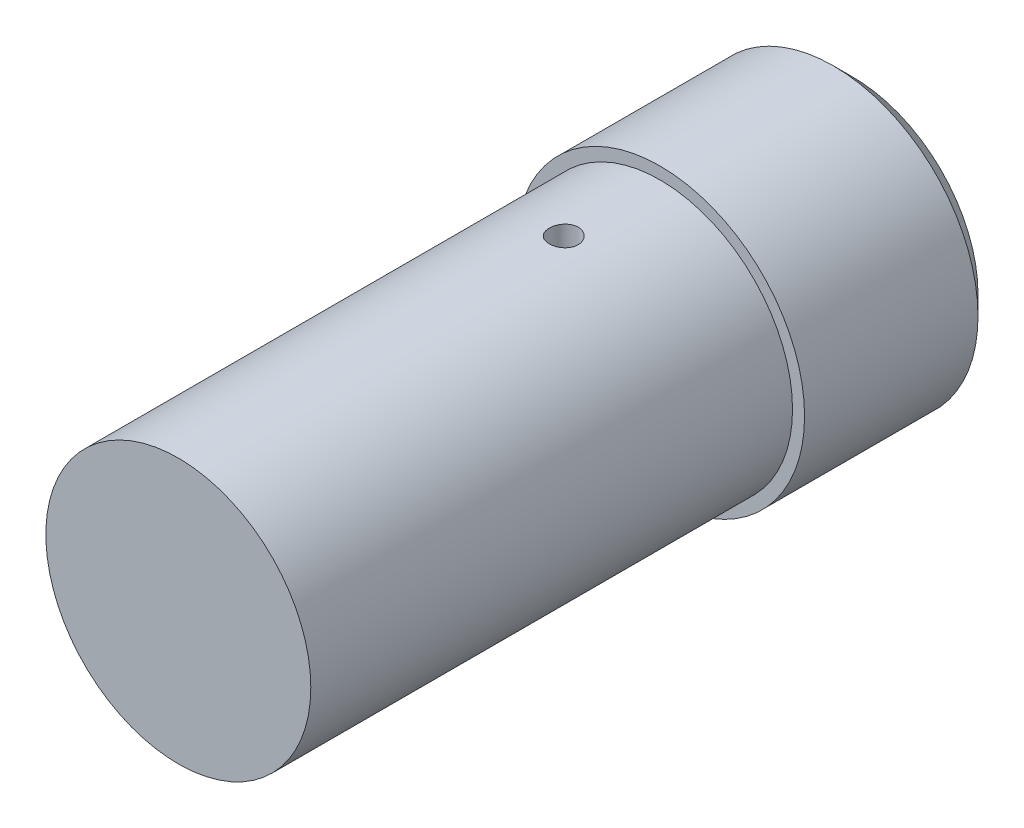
ISO-10303-21;
HEADER;
FILE_DESCRIPTION(('STEP AP214'),'2;1');
FILE_NAME('part.step','',(''),(''),'','','');
FILE_SCHEMA(('AUTOMOTIVE_DESIGN { 1 0 10303 214 1 1 1 1 }'));
ENDSEC;
DATA;
#1=APPLICATION_CONTEXT('core data for automotive mechanical design processes');
#2=APPLICATION_PROTOCOL_DEFINITION('international standard','automotive_design',2000,#1);
#3=PRODUCT_CONTEXT('',#1,'mechanical');
#4=PRODUCT('Part','Part','',(#3));
#5=PRODUCT_RELATED_PRODUCT_CATEGORY('part','',(#4));
#6=PRODUCT_DEFINITION_FORMATION('','',#4);
#7=PRODUCT_DEFINITION_CONTEXT('part definition',#1,'design');
#8=PRODUCT_DEFINITION('design','',#6,#7);
#9=PRODUCT_DEFINITION_SHAPE('','',#8);
#10=(LENGTH_UNIT() NAMED_UNIT(*) SI_UNIT(.MILLI.,.METRE.));
#11=(NAMED_UNIT(*) PLANE_ANGLE_UNIT() SI_UNIT($,.RADIAN.));
#12=(NAMED_UNIT(*) SI_UNIT($,.STERADIAN.) SOLID_ANGLE_UNIT());
#13=UNCERTAINTY_MEASURE_WITH_UNIT(LENGTH_MEASURE(1.E-05),#10,'distance_accuracy_value','');
#14=(GEOMETRIC_REPRESENTATION_CONTEXT(3) GLOBAL_UNCERTAINTY_ASSIGNED_CONTEXT((#13)) GLOBAL_UNIT_ASSIGNED_CONTEXT((#10,
#11,#12)) REPRESENTATION_CONTEXT('',''));
#15=CARTESIAN_POINT('',(0.,0.,0.));
#16=DIRECTION('',(0.,0.,1.));
#17=DIRECTION('',(1.,0.,0.));
#18=AXIS2_PLACEMENT_3D('',#15,#16,#17);
#19=CARTESIAN_POINT('',(0.,0.,40.));
#20=DIRECTION('',(0.,0.,1.));
#21=DIRECTION('',(1.,0.,0.));
#22=AXIS2_PLACEMENT_3D('',#19,#20,#21);
#23=PLANE('',#22);
#24=CARTESIAN_POINT('',(0.,0.,40.));
#25=DIRECTION('',(0.,0.,1.));
#26=DIRECTION('',(1.,0.,0.));
#27=AXIS2_PLACEMENT_3D('',#24,#25,#26);
#28=CIRCLE('',#27,30.);
#29=CARTESIAN_POINT('',(30.,0.,40.));
#30=VERTEX_POINT('',#29);
#31=EDGE_CURVE('E43',#30,#30,#28,.T.);
#32=ORIENTED_EDGE('',*,*,#31,.T.);
#33=EDGE_LOOP('',(#32));
#34=FACE_BOUND('',#33,.T.);
#35=CARTESIAN_POINT('',(0.,0.,40.));
#36=DIRECTION('',(0.,0.,1.));
#37=DIRECTION('',(1.,0.,0.));
#38=AXIS2_PLACEMENT_3D('',#35,#36,#37);
#39=CIRCLE('',#38,27.5);
#40=CARTESIAN_POINT('',(27.5,0.,40.));
#41=VERTEX_POINT('',#40);
#42=EDGE_CURVE('E57',#41,#41,#39,.T.);
#43=ORIENTED_EDGE('',*,*,#42,.F.);
#44=EDGE_LOOP('',(#43));
#45=FACE_BOUND('',#44,.T.);
#46=ADVANCED_FACE('F32',(#34,#45),#23,.T.);
#47=CARTESIAN_POINT('',(0.,0.,40.));
#48=DIRECTION('',(0.,0.,-1.));
#49=DIRECTION('',(-1.,0.,0.));
#50=AXIS2_PLACEMENT_3D('',#47,#48,#49);
#51=CYLINDRICAL_SURFACE('',#50,30.);
#52=CARTESIAN_POINT('',(0.,0.,4.00000000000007));
#53=DIRECTION('',(0.,0.,1.));
#54=DIRECTION('',(1.,0.,0.));
#55=AXIS2_PLACEMENT_3D('',#52,#53,#54);
#56=CIRCLE('',#55,30.);
#57=CARTESIAN_POINT('',(30.,0.,4.00000000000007));
#58=VERTEX_POINT('',#57);
#59=EDGE_CURVE('E39',#58,#58,#56,.T.);
#60=ORIENTED_EDGE('',*,*,#59,.T.);
#61=EDGE_LOOP('',(#60));
#62=FACE_BOUND('',#61,.T.);
#63=ORIENTED_EDGE('',*,*,#31,.F.);
#64=EDGE_LOOP('',(#63));
#65=FACE_BOUND('',#64,.T.);
#66=ADVANCED_FACE('F80',(#62,#65),#51,.T.);
#67=CARTESIAN_POINT('',(0.,0.,0.));
#68=DIRECTION('',(0.,0.,1.));
#69=DIRECTION('',(1.,0.,0.));
#70=AXIS2_PLACEMENT_3D('',#67,#68,#69);
#71=PLANE('',#70);
#72=CARTESIAN_POINT('',(0.,0.,0.));
#73=DIRECTION('',(0.,0.,1.));
#74=DIRECTION('',(1.,0.,0.));
#75=AXIS2_PLACEMENT_3D('',#72,#73,#74);
#76=CIRCLE('',#75,26.);
#77=CARTESIAN_POINT('',(26.,0.,0.));
#78=VERTEX_POINT('',#77);
#79=EDGE_CURVE('E10',#78,#78,#76,.F.);
#80=ORIENTED_EDGE('',*,*,#79,.T.);
#81=EDGE_LOOP('',(#80));
#82=FACE_BOUND('',#81,.T.);
#83=ADVANCED_FACE('F76',(#82),#71,.F.);
#84=CARTESIAN_POINT('',(0.,0.,140.));
#85=DIRECTION('',(0.,0.,-1.));
#86=DIRECTION('',(-1.,0.,0.));
#87=AXIS2_PLACEMENT_3D('',#84,#85,#86);
#88=CYLINDRICAL_SURFACE('',#87,27.5);
#89=CARTESIAN_POINT('',(0.,27.5,63.));
#90=CARTESIAN_POINT('',(-0.167975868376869,27.4999979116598,62.9999927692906));
#91=CARTESIAN_POINT('',(-0.336060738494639,27.4984446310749,62.9858445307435));
#92=CARTESIAN_POINT('',(-0.667564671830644,27.492397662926,62.9296213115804));
#93=CARTESIAN_POINT('',(-0.83097848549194,27.4879007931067,62.88751610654));
#94=CARTESIAN_POINT('',(-1.14829223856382,27.4764739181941,62.7766243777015));
#95=CARTESIAN_POINT('',(-1.30219807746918,27.4695454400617,62.7078545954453));
#96=CARTESIAN_POINT('',(-1.59625097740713,27.4540286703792,62.5456197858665));
#97=CARTESIAN_POINT('',(-1.73640063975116,27.445440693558,62.4521594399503));
#98=CARTESIAN_POINT('',(-1.99958990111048,27.4275251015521,62.2427713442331));
#99=CARTESIAN_POINT('',(-2.12256280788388,27.4181948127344,62.1267599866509));
#100=CARTESIAN_POINT('',(-2.34733416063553,27.3998680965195,61.8757418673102));
#101=CARTESIAN_POINT('',(-2.44913159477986,27.3908716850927,61.7407341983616));
#102=CARTESIAN_POINT('',(-2.62890315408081,27.374204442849,61.4551323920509));
#103=CARTESIAN_POINT('',(-2.70681613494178,27.3665370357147,61.304499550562));
#104=CARTESIAN_POINT('',(-2.8362166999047,27.353429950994,60.9921908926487));
#105=CARTESIAN_POINT('',(-2.88770505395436,27.3479902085,60.8305153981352));
#106=CARTESIAN_POINT('',(-2.96259521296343,27.3399790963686,60.5013957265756));
#107=CARTESIAN_POINT('',(-2.98610841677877,27.3373963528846,60.3339771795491));
#108=CARTESIAN_POINT('',(-3.00472529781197,27.3353565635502,59.9975517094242));
#109=CARTESIAN_POINT('',(-2.99982985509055,27.3358994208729,59.8285448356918));
#110=CARTESIAN_POINT('',(-2.96186009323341,27.3400390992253,59.4945109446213));
#111=CARTESIAN_POINT('',(-2.92890776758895,27.3436226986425,59.3294698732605));
#112=CARTESIAN_POINT('',(-2.83594963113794,27.353419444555,59.0072745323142));
#113=CARTESIAN_POINT('',(-2.77594339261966,27.3596326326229,58.8501203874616));
#114=CARTESIAN_POINT('',(-2.6304473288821,27.374003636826,58.5477767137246));
#115=CARTESIAN_POINT('',(-2.54490375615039,27.3821655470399,58.4026132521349));
#116=CARTESIAN_POINT('',(-2.35079985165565,27.3995110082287,58.1286569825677));
#117=CARTESIAN_POINT('',(-2.24223871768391,27.4086945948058,57.9998647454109));
#118=CARTESIAN_POINT('',(-2.00450176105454,27.4271075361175,57.761598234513));
#119=CARTESIAN_POINT('',(-1.87522065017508,27.4363368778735,57.6522289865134));
#120=CARTESIAN_POINT('',(-1.6000781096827,27.4537560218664,57.4567283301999));
#121=CARTESIAN_POINT('',(-1.45421665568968,27.4619458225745,57.3705969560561));
#122=CARTESIAN_POINT('',(-1.14997834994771,27.4763665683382,57.2240197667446));
#123=CARTESIAN_POINT('',(-0.991598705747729,27.4825970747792,57.1635797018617));
#124=CARTESIAN_POINT('',(-0.666856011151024,27.4923929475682,57.0701799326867));
#125=CARTESIAN_POINT('',(-0.500493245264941,27.495958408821,57.0372192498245));
#126=CARTESIAN_POINT('',(-0.165415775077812,27.5000102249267,56.9998480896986));
#127=CARTESIAN_POINT('',(0.00328259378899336,27.5005122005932,56.9952927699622));
#128=CARTESIAN_POINT('',(0.339040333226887,27.4984224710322,57.0144806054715));
#129=CARTESIAN_POINT('',(0.506099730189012,27.4958308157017,57.0382233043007));
#130=CARTESIAN_POINT('',(0.833416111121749,27.4878549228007,57.1132129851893));
#131=CARTESIAN_POINT('',(0.993688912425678,27.4824776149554,57.1643917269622));
#132=CARTESIAN_POINT('',(1.30337528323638,27.4695332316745,57.2927303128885));
#133=CARTESIAN_POINT('',(1.45278856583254,27.4619660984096,57.3698908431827));
#134=CARTESIAN_POINT('',(1.73716679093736,27.4454485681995,57.5483589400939));
#135=CARTESIAN_POINT('',(1.87207200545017,27.4364927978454,57.6497611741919));
#136=CARTESIAN_POINT('',(2.12299899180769,27.4182190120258,57.8736991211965));
#137=CARTESIAN_POINT('',(2.23902019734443,27.4089009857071,57.996235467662));
#138=CARTESIAN_POINT('',(2.44939239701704,27.3909054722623,58.2595973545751));
#139=CARTESIAN_POINT('',(2.54364800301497,27.3822309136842,58.4004993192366));
#140=CARTESIAN_POINT('',(2.70715660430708,27.3665503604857,58.6962178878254));
#141=CARTESIAN_POINT('',(2.77640999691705,27.3595443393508,58.8510342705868));
#142=CARTESIAN_POINT('',(2.8877903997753,27.348013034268,59.1698664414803));
#143=CARTESIAN_POINT('',(2.92997315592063,27.3434826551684,59.3338625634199));
#144=CARTESIAN_POINT('',(2.98619531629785,27.3374002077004,59.6666622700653));
#145=CARTESIAN_POINT('',(3.00023569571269,27.3358480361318,59.8354656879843));
#146=CARTESIAN_POINT('',(2.99975954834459,27.3359002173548,60.1721399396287));
#147=CARTESIAN_POINT('',(2.98539286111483,27.3374880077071,60.3400110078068));
#148=CARTESIAN_POINT('',(2.92882562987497,27.3436057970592,60.6709388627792));
#149=CARTESIAN_POINT('',(2.8866250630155,27.3481357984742,60.8339956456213));
#150=CARTESIAN_POINT('',(2.77563125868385,27.3596228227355,61.1506588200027));
#151=CARTESIAN_POINT('',(2.70684339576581,27.366579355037,61.30426711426));
#152=CARTESIAN_POINT('',(2.54464271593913,27.3821365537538,61.5977827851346));
#153=CARTESIAN_POINT('',(2.45122988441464,27.3907372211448,61.7376901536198));
#154=CARTESIAN_POINT('',(2.24187003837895,27.4086680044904,62.0006000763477));
#155=CARTESIAN_POINT('',(2.12581126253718,27.4180015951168,62.123513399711));
#156=CARTESIAN_POINT('',(1.87468089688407,27.4363151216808,62.3481823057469));
#157=CARTESIAN_POINT('',(1.73960478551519,27.4452949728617,62.4499328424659));
#158=CARTESIAN_POINT('',(1.45383048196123,27.4619174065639,62.6296312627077));
#159=CARTESIAN_POINT('',(1.30308750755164,27.4695559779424,62.707508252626));
#160=CARTESIAN_POINT('',(0.990672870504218,27.4825928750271,62.836737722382));
#161=CARTESIAN_POINT('',(0.829013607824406,27.4879936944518,62.8881197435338));
#162=CARTESIAN_POINT('',(0.555387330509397,27.494608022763,62.9502608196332));
#163=CARTESIAN_POINT('',(0.445162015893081,27.4966204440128,62.9688870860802));
#164=CARTESIAN_POINT('',(0.223307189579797,27.4993171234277,62.9937590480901));
#165=CARTESIAN_POINT('',(0.111677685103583,27.5000013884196,63.000004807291));
#166=CARTESIAN_POINT('',(0.,27.5,63.));
#167=B_SPLINE_CURVE_WITH_KNOTS('',3,(#89,#90,#91,#92,#93,#94,#95,#96,#97,#98,#99,#100,#101,#102,
#103,#104,#105,#106,#107,#108,#109,#110,#111,#112,#113,#114,#115,#116,#117,#118,#119,#120,#121,
#122,#123,#124,#125,#126,#127,#128,#129,#130,#131,#132,#133,#134,#135,#136,#137,#138,#139,#140,
#141,#142,#143,#144,#145,#146,#147,#148,#149,#150,#151,#152,#153,#154,#155,#156,#157,#158,#159,
#160,#161,#162,#163,#164,#165,#166),.UNSPECIFIED.,.T.,.F.,(4,2,2,2,2,2,2,2,2,2,2,2,2,2,2,2,2,2,
2,2,2,2,2,2,2,2,2,2,2,2,2,2,2,2,2,2,2,2,4),(0.,0.503519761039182,1.00758476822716,
1.51133380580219,2.01498739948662,2.52054518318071,3.02612711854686,3.53299274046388,
4.03984359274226,4.5446693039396,5.04947937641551,5.55210563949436,6.05473984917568,
6.55843948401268,7.06215667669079,7.56851976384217,8.07488359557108,8.58136070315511,
9.08781977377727,9.59169422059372,10.0955605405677,10.5981793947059,11.1008115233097,
11.6054395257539,12.1100826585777,12.6168971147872,13.1237035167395,13.6294628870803,
14.1352047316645,14.6382860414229,15.1413677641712,15.6443478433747,16.1473282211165,
16.6528567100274,17.1585055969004,17.6656418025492,18.1722113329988,18.5069749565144,
18.8417368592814),.UNSPECIFIED.);
#168=CARTESIAN_POINT('',(0.,27.5,63.));
#169=VERTEX_POINT('',#168);
#170=EDGE_CURVE('E50',#169,#169,#167,.T.);
#171=ORIENTED_EDGE('',*,*,#170,.T.);
#172=EDGE_LOOP('',(#171));
#173=FACE_BOUND('',#172,.T.);
#174=CARTESIAN_POINT('',(0.,0.,140.));
#175=DIRECTION('',(0.,0.,1.));
#176=DIRECTION('',(1.,0.,0.));
#177=AXIS2_PLACEMENT_3D('',#174,#175,#176);
#178=CIRCLE('',#177,27.5);
#179=CARTESIAN_POINT('',(27.5,0.,140.));
#180=VERTEX_POINT('',#179);
#181=EDGE_CURVE('E47',#180,#180,#178,.T.);
#182=ORIENTED_EDGE('',*,*,#181,.F.);
#183=EDGE_LOOP('',(#182));
#184=FACE_BOUND('',#183,.T.);
#185=ORIENTED_EDGE('',*,*,#42,.T.);
#186=EDGE_LOOP('',(#185));
#187=FACE_BOUND('',#186,.T.);
#188=ADVANCED_FACE('F60',(#173,#184,#187),#88,.T.);
#189=CARTESIAN_POINT('',(0.,0.,140.));
#190=DIRECTION('',(0.,0.,1.));
#191=DIRECTION('',(1.,0.,0.));
#192=AXIS2_PLACEMENT_3D('',#189,#190,#191);
#193=PLANE('',#192);
#194=ORIENTED_EDGE('',*,*,#181,.T.);
#195=EDGE_LOOP('',(#194));
#196=FACE_BOUND('',#195,.T.);
#197=ADVANCED_FACE('F69',(#196),#193,.T.);
#198=CARTESIAN_POINT('',(0.,0.,60.));
#199=DIRECTION('',(0.,1.,0.));
#200=DIRECTION('',(0.,0.,1.));
#201=AXIS2_PLACEMENT_3D('',#198,#199,#200);
#202=CYLINDRICAL_SURFACE('',#201,3.);
#203=CARTESIAN_POINT('',(0.,0.,60.));
#204=DIRECTION('',(0.,1.,0.));
#205=DIRECTION('',(0.,0.,1.));
#206=AXIS2_PLACEMENT_3D('',#203,#204,#205);
#207=CIRCLE('',#206,3.);
#208=CARTESIAN_POINT('',(0.,0.,63.));
#209=VERTEX_POINT('',#208);
#210=EDGE_CURVE('E58',#209,#209,#207,.T.);
#211=ORIENTED_EDGE('',*,*,#210,.F.);
#212=EDGE_LOOP('',(#211));
#213=FACE_BOUND('',#212,.T.);
#214=ORIENTED_EDGE('',*,*,#170,.F.);
#215=EDGE_LOOP('',(#214));
#216=FACE_BOUND('',#215,.T.);
#217=ADVANCED_FACE('F64',(#213,#216),#202,.F.);
#218=CARTESIAN_POINT('',(0.,0.,60.));
#219=DIRECTION('',(0.,1.,0.));
#220=DIRECTION('',(0.,0.,1.));
#221=AXIS2_PLACEMENT_3D('',#218,#219,#220);
#222=PLANE('',#221);
#223=ORIENTED_EDGE('',*,*,#210,.T.);
#224=EDGE_LOOP('',(#223));
#225=FACE_BOUND('',#224,.T.);
#226=ADVANCED_FACE('F68',(#225),#222,.T.);
#227=CARTESIAN_POINT('',(0.,0.,4.00000000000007));
#228=DIRECTION('',(0.,0.,1.));
#229=DIRECTION('',(1.,0.,0.));
#230=AXIS2_PLACEMENT_3D('',#227,#228,#229);
#231=CONICAL_SURFACE('',#230,30.,0.785398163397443);
#232=ORIENTED_EDGE('',*,*,#79,.F.);
#233=EDGE_LOOP('',(#232));
#234=FACE_BOUND('',#233,.T.);
#235=ORIENTED_EDGE('',*,*,#59,.F.);
#236=EDGE_LOOP('',(#235));
#237=FACE_BOUND('',#236,.T.);
#238=ADVANCED_FACE('F34',(#234,#237),#231,.T.);
#239=CLOSED_SHELL('',(#46,#66,#83,#188,#197,#217,#226,#238));
#240=MANIFOLD_SOLID_BREP('B2',#239);
#241=ADVANCED_BREP_SHAPE_REPRESENTATION('',(#18,#240),#14);
#242=SHAPE_DEFINITION_REPRESENTATION(#9,#241);
ENDSEC;
END-ISO-10303-21;
